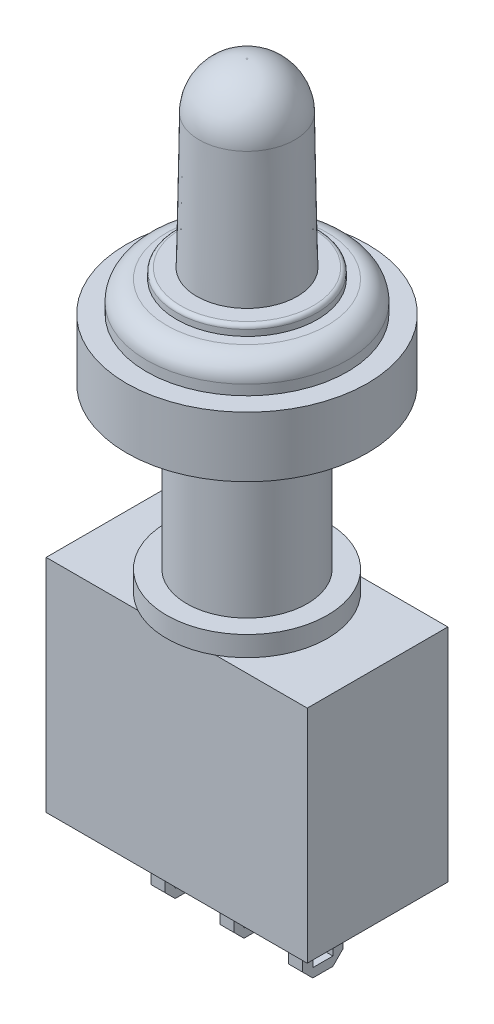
ISO-10303-21;
HEADER;
FILE_DESCRIPTION(('STEP AP214'),'2;1');
FILE_NAME('part.step','',(''),(''),'','','');
FILE_SCHEMA(('AUTOMOTIVE_DESIGN { 1 0 10303 214 1 1 1 1 }'));
ENDSEC;
DATA;
#1=APPLICATION_CONTEXT('core data for automotive mechanical design processes');
#2=APPLICATION_PROTOCOL_DEFINITION('international standard','automotive_design',2000,#1);
#3=PRODUCT_CONTEXT('',#1,'mechanical');
#4=PRODUCT('Part','Part','',(#3));
#5=PRODUCT_RELATED_PRODUCT_CATEGORY('part','',(#4));
#6=PRODUCT_DEFINITION_FORMATION('','',#4);
#7=PRODUCT_DEFINITION_CONTEXT('part definition',#1,'design');
#8=PRODUCT_DEFINITION('design','',#6,#7);
#9=PRODUCT_DEFINITION_SHAPE('','',#8);
#10=(LENGTH_UNIT() NAMED_UNIT(*) SI_UNIT(.MILLI.,.METRE.));
#11=(NAMED_UNIT(*) PLANE_ANGLE_UNIT() SI_UNIT($,.RADIAN.));
#12=(NAMED_UNIT(*) SI_UNIT($,.STERADIAN.) SOLID_ANGLE_UNIT());
#13=UNCERTAINTY_MEASURE_WITH_UNIT(LENGTH_MEASURE(1.E-05),#10,'distance_accuracy_value','');
#14=(GEOMETRIC_REPRESENTATION_CONTEXT(3) GLOBAL_UNCERTAINTY_ASSIGNED_CONTEXT((#13)) GLOBAL_UNIT_ASSIGNED_CONTEXT((#10,
#11,#12)) REPRESENTATION_CONTEXT('',''));
#15=CARTESIAN_POINT('',(0.,0.,0.));
#16=DIRECTION('',(0.,0.,1.));
#17=DIRECTION('',(1.,0.,0.));
#18=AXIS2_PLACEMENT_3D('',#15,#16,#17);
#19=CARTESIAN_POINT('',(-40.,9.00000000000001,6.99999999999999));
#20=DIRECTION('',(0.,1.,0.));
#21=DIRECTION('',(-1.,0.,0.));
#22=AXIS2_PLACEMENT_3D('',#19,#20,#21);
#23=PLANE('',#22);
#24=DIRECTION('',(0.,0.,-1.));
#25=VECTOR('',#24,1.);
#26=CARTESIAN_POINT('',(-33.85,9.00000000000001,4.49999999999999));
#27=LINE('',#26,#25);
#28=CARTESIAN_POINT('',(-33.85,9.00000000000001,4.49999999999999));
#29=VERTEX_POINT('',#28);
#30=CARTESIAN_POINT('',(-33.85,9.00000000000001,2.5));
#31=VERTEX_POINT('',#30);
#32=EDGE_CURVE('E398',#29,#31,#27,.T.);
#33=ORIENTED_EDGE('',*,*,#32,.F.);
#34=DIRECTION('',(-1.,0.,0.));
#35=VECTOR('',#34,1.);
#36=CARTESIAN_POINT('',(-33.85,9.00000000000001,4.49999999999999));
#37=LINE('',#36,#35);
#38=CARTESIAN_POINT('',(-33.15,8.99999999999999,4.49999999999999));
#39=VERTEX_POINT('',#38);
#40=EDGE_CURVE('E407',#39,#29,#37,.T.);
#41=ORIENTED_EDGE('',*,*,#40,.F.);
#42=DIRECTION('',(0.,0.,1.));
#43=VECTOR('',#42,1.);
#44=CARTESIAN_POINT('',(-33.15,8.99999999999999,4.49999999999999));
#45=LINE('',#44,#43);
#46=CARTESIAN_POINT('',(-33.15,9.00000000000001,2.5));
#47=VERTEX_POINT('',#46);
#48=EDGE_CURVE('E404',#47,#39,#45,.T.);
#49=ORIENTED_EDGE('',*,*,#48,.F.);
#50=DIRECTION('',(1.,0.,0.));
#51=VECTOR('',#50,1.);
#52=CARTESIAN_POINT('',(-33.85,9.00000000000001,2.5));
#53=LINE('',#52,#51);
#54=EDGE_CURVE('E401',#31,#47,#53,.T.);
#55=ORIENTED_EDGE('',*,*,#54,.F.);
#56=EDGE_LOOP('',(#33,#41,#49,#55));
#57=FACE_BOUND('',#56,.T.);
#58=DIRECTION('',(1.,0.,0.));
#59=VECTOR('',#58,1.);
#60=CARTESIAN_POINT('',(-40.,9.00000000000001,0.));
#61=LINE('',#60,#59);
#62=CARTESIAN_POINT('',(-40.,9.00000000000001,0.));
#63=VERTEX_POINT('',#62);
#64=CARTESIAN_POINT('',(-27.,9.00000000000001,0.));
#65=VERTEX_POINT('',#64);
#66=EDGE_CURVE('E483',#63,#65,#61,.T.);
#67=ORIENTED_EDGE('',*,*,#66,.T.);
#68=DIRECTION('',(0.,0.,-1.));
#69=VECTOR('',#68,1.);
#70=CARTESIAN_POINT('',(-27.,9.00000000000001,7.));
#71=LINE('',#70,#69);
#72=CARTESIAN_POINT('',(-27.,9.00000000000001,7.));
#73=VERTEX_POINT('',#72);
#74=EDGE_CURVE('E510',#73,#65,#71,.T.);
#75=ORIENTED_EDGE('',*,*,#74,.F.);
#76=DIRECTION('',(1.,0.,0.));
#77=VECTOR('',#76,1.);
#78=CARTESIAN_POINT('',(-40.,9.00000000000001,6.99999999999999));
#79=LINE('',#78,#77);
#80=CARTESIAN_POINT('',(-40.,9.00000000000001,6.99999999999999));
#81=VERTEX_POINT('',#80);
#82=EDGE_CURVE('E495',#81,#73,#79,.T.);
#83=ORIENTED_EDGE('',*,*,#82,.F.);
#84=DIRECTION('',(0.,0.,-1.));
#85=VECTOR('',#84,1.);
#86=CARTESIAN_POINT('',(-40.,9.00000000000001,6.99999999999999));
#87=LINE('',#86,#85);
#88=EDGE_CURVE('E513',#81,#63,#87,.T.);
#89=ORIENTED_EDGE('',*,*,#88,.T.);
#90=EDGE_LOOP('',(#67,#75,#83,#89));
#91=FACE_BOUND('',#90,.T.);
#92=DIRECTION('',(0.,0.,-1.));
#93=VECTOR('',#92,1.);
#94=CARTESIAN_POINT('',(-37.275,9.00000000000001,4.5));
#95=LINE('',#94,#93);
#96=CARTESIAN_POINT('',(-37.275,9.00000000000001,4.5));
#97=VERTEX_POINT('',#96);
#98=CARTESIAN_POINT('',(-37.275,9.00000000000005,2.49999999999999));
#99=VERTEX_POINT('',#98);
#100=EDGE_CURVE('E424',#97,#99,#95,.T.);
#101=ORIENTED_EDGE('',*,*,#100,.F.);
#102=DIRECTION('',(-1.,0.,0.));
#103=VECTOR('',#102,1.);
#104=CARTESIAN_POINT('',(-37.275,9.00000000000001,4.5));
#105=LINE('',#104,#103);
#106=CARTESIAN_POINT('',(-36.575,9.00000000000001,4.5));
#107=VERTEX_POINT('',#106);
#108=EDGE_CURVE('E433',#107,#97,#105,.T.);
#109=ORIENTED_EDGE('',*,*,#108,.F.);
#110=DIRECTION('',(0.,0.,1.));
#111=VECTOR('',#110,1.);
#112=CARTESIAN_POINT('',(-36.575,9.00000000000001,4.5));
#113=LINE('',#112,#111);
#114=CARTESIAN_POINT('',(-36.575,9.00000000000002,2.49999999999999));
#115=VERTEX_POINT('',#114);
#116=EDGE_CURVE('E430',#115,#107,#113,.T.);
#117=ORIENTED_EDGE('',*,*,#116,.F.);
#118=DIRECTION('',(1.,0.,0.));
#119=VECTOR('',#118,1.);
#120=CARTESIAN_POINT('',(-37.275,9.00000000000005,2.5));
#121=LINE('',#120,#119);
#122=EDGE_CURVE('E427',#99,#115,#121,.T.);
#123=ORIENTED_EDGE('',*,*,#122,.F.);
#124=EDGE_LOOP('',(#101,#109,#117,#123));
#125=FACE_BOUND('',#124,.T.);
#126=DIRECTION('',(0.,0.,-1.));
#127=VECTOR('',#126,1.);
#128=CARTESIAN_POINT('',(-30.425,9.00000000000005,4.5));
#129=LINE('',#128,#127);
#130=CARTESIAN_POINT('',(-30.425,9.00000000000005,4.5));
#131=VERTEX_POINT('',#130);
#132=CARTESIAN_POINT('',(-30.425,9.00000000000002,2.49999999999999));
#133=VERTEX_POINT('',#132);
#134=EDGE_CURVE('E372',#131,#133,#129,.T.);
#135=ORIENTED_EDGE('',*,*,#134,.F.);
#136=DIRECTION('',(-1.,0.,0.));
#137=VECTOR('',#136,1.);
#138=CARTESIAN_POINT('',(-30.425,9.00000000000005,4.5));
#139=LINE('',#138,#137);
#140=CARTESIAN_POINT('',(-29.725,9.00000000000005,4.5));
#141=VERTEX_POINT('',#140);
#142=EDGE_CURVE('E381',#141,#131,#139,.T.);
#143=ORIENTED_EDGE('',*,*,#142,.F.);
#144=DIRECTION('',(0.,0.,1.));
#145=VECTOR('',#144,1.);
#146=CARTESIAN_POINT('',(-29.725,9.00000000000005,4.5));
#147=LINE('',#146,#145);
#148=CARTESIAN_POINT('',(-29.725,9.00000000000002,2.5));
#149=VERTEX_POINT('',#148);
#150=EDGE_CURVE('E378',#149,#141,#147,.T.);
#151=ORIENTED_EDGE('',*,*,#150,.F.);
#152=DIRECTION('',(1.,0.,0.));
#153=VECTOR('',#152,1.);
#154=CARTESIAN_POINT('',(-30.425,9.00000000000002,2.49999999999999));
#155=LINE('',#154,#153);
#156=EDGE_CURVE('E375',#133,#149,#155,.T.);
#157=ORIENTED_EDGE('',*,*,#156,.F.);
#158=EDGE_LOOP('',(#135,#143,#151,#157));
#159=FACE_BOUND('',#158,.T.);
#160=ADVANCED_FACE('F39',(#57,#91,#125,#159),#23,.F.);
#161=CARTESIAN_POINT('',(-33.5,34.,3.5));
#162=DIRECTION('',(0.,1.,0.));
#163=DIRECTION('',(0.,0.,1.));
#164=AXIS2_PLACEMENT_3D('',#161,#162,#163);
#165=PLANE('',#164);
#166=CARTESIAN_POINT('',(-33.5,34.,3.5));
#167=DIRECTION('',(0.,1.,0.));
#168=DIRECTION('',(0.,0.,1.));
#169=AXIS2_PLACEMENT_3D('',#166,#167,#168);
#170=CIRCLE('',#169,3.3);
#171=CARTESIAN_POINT('',(-33.5,34.,6.8));
#172=VERTEX_POINT('',#171);
#173=EDGE_CURVE('E522',#172,#172,#170,.T.);
#174=ORIENTED_EDGE('',*,*,#173,.T.);
#175=EDGE_LOOP('',(#174));
#176=FACE_BOUND('',#175,.T.);
#177=CARTESIAN_POINT('',(-33.5,34.,3.5));
#178=DIRECTION('',(0.,1.,0.));
#179=DIRECTION('',(0.,0.,1.));
#180=AXIS2_PLACEMENT_3D('',#177,#178,#179);
#181=CIRCLE('',#180,2.5);
#182=CARTESIAN_POINT('',(-33.5,34.,6.));
#183=VERTEX_POINT('',#182);
#184=EDGE_CURVE('E450',#183,#183,#181,.T.);
#185=ORIENTED_EDGE('',*,*,#184,.F.);
#186=EDGE_LOOP('',(#185));
#187=FACE_BOUND('',#186,.T.);
#188=ADVANCED_FACE('F614',(#176,#187),#165,.T.);
#189=CARTESIAN_POINT('',(-33.5,33.5,3.5));
#190=DIRECTION('',(0.,1.,0.));
#191=DIRECTION('',(0.,0.,1.));
#192=AXIS2_PLACEMENT_3D('',#189,#190,#191);
#193=PLANE('',#192);
#194=CARTESIAN_POINT('',(-33.5,33.5,3.5));
#195=DIRECTION('',(0.,1.,0.));
#196=DIRECTION('',(0.,0.,1.));
#197=AXIS2_PLACEMENT_3D('',#194,#195,#196);
#198=CIRCLE('',#197,4.);
#199=CARTESIAN_POINT('',(-33.5,33.5,7.5));
#200=VERTEX_POINT('',#199);
#201=EDGE_CURVE('E516',#200,#200,#198,.T.);
#202=ORIENTED_EDGE('',*,*,#201,.T.);
#203=EDGE_LOOP('',(#202));
#204=FACE_BOUND('',#203,.T.);
#205=CARTESIAN_POINT('',(-33.5,33.5,3.5));
#206=DIRECTION('',(0.,1.,0.));
#207=DIRECTION('',(0.,0.,1.));
#208=AXIS2_PLACEMENT_3D('',#205,#206,#207);
#209=CIRCLE('',#208,3.5);
#210=CARTESIAN_POINT('',(-33.5,33.5,7.));
#211=VERTEX_POINT('',#210);
#212=EDGE_CURVE('E453',#211,#211,#209,.T.);
#213=ORIENTED_EDGE('',*,*,#212,.F.);
#214=EDGE_LOOP('',(#213));
#215=FACE_BOUND('',#214,.T.);
#216=ADVANCED_FACE('F621',(#204,#215),#193,.T.);
#217=CARTESIAN_POINT('',(-33.5,32.,3.5));
#218=DIRECTION('',(0.,1.,0.));
#219=DIRECTION('',(0.,0.,1.));
#220=AXIS2_PLACEMENT_3D('',#217,#218,#219);
#221=PLANE('',#220);
#222=CARTESIAN_POINT('',(-33.5,32.,3.5));
#223=DIRECTION('',(0.,1.,0.));
#224=DIRECTION('',(0.,0.,1.));
#225=AXIS2_PLACEMENT_3D('',#222,#223,#224);
#226=CIRCLE('',#225,5.99999999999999);
#227=CARTESIAN_POINT('',(-33.5,32.,9.49999999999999));
#228=VERTEX_POINT('',#227);
#229=EDGE_CURVE('E462',#228,#228,#226,.T.);
#230=ORIENTED_EDGE('',*,*,#229,.T.);
#231=EDGE_LOOP('',(#230));
#232=FACE_BOUND('',#231,.T.);
#233=CARTESIAN_POINT('',(-33.5,32.,3.5));
#234=DIRECTION('',(0.,1.,0.));
#235=DIRECTION('',(0.,0.,1.));
#236=AXIS2_PLACEMENT_3D('',#233,#234,#235);
#237=CIRCLE('',#236,5.);
#238=CARTESIAN_POINT('',(-33.5,32.,8.49999999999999));
#239=VERTEX_POINT('',#238);
#240=EDGE_CURVE('E456',#239,#239,#237,.T.);
#241=ORIENTED_EDGE('',*,*,#240,.F.);
#242=EDGE_LOOP('',(#241));
#243=FACE_BOUND('',#242,.T.);
#244=ADVANCED_FACE('F653',(#232,#243),#221,.T.);
#245=CARTESIAN_POINT('',(-33.5,21.,3.5));
#246=DIRECTION('',(0.,1.,0.));
#247=DIRECTION('',(0.,0.,1.));
#248=AXIS2_PLACEMENT_3D('',#245,#246,#247);
#249=PLANE('',#248);
#250=CARTESIAN_POINT('',(-33.5,21.,3.5));
#251=DIRECTION('',(0.,1.,0.));
#252=DIRECTION('',(0.,0.,1.));
#253=AXIS2_PLACEMENT_3D('',#250,#251,#252);
#254=CIRCLE('',#253,4.00000000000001);
#255=CARTESIAN_POINT('',(-33.5,21.,7.50000000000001));
#256=VERTEX_POINT('',#255);
#257=EDGE_CURVE('E475',#256,#256,#254,.T.);
#258=ORIENTED_EDGE('',*,*,#257,.T.);
#259=EDGE_LOOP('',(#258));
#260=FACE_BOUND('',#259,.T.);
#261=CARTESIAN_POINT('',(-33.5,21.,3.5));
#262=DIRECTION('',(0.,1.,0.));
#263=DIRECTION('',(0.,0.,1.));
#264=AXIS2_PLACEMENT_3D('',#261,#262,#263);
#265=CIRCLE('',#264,3.);
#266=CARTESIAN_POINT('',(-33.5,21.,6.5));
#267=VERTEX_POINT('',#266);
#268=EDGE_CURVE('E465',#267,#267,#265,.T.);
#269=ORIENTED_EDGE('',*,*,#268,.F.);
#270=EDGE_LOOP('',(#269));
#271=FACE_BOUND('',#270,.T.);
#272=ADVANCED_FACE('F636',(#260,#271),#249,.T.);
#273=CARTESIAN_POINT('',(-40.,20.,6.99999999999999));
#274=DIRECTION('',(0.,-1.,0.));
#275=DIRECTION('',(0.,0.,-1.));
#276=AXIS2_PLACEMENT_3D('',#273,#274,#275);
#277=PLANE('',#276);
#278=CARTESIAN_POINT('',(-33.5,20.,3.5));
#279=DIRECTION('',(0.,1.,0.));
#280=DIRECTION('',(0.,0.,1.));
#281=AXIS2_PLACEMENT_3D('',#278,#279,#280);
#282=CIRCLE('',#281,4.00000000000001);
#283=CARTESIAN_POINT('',(-31.5635083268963,20.,6.99999999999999));
#284=VERTEX_POINT('',#283);
#285=CARTESIAN_POINT('',(-31.5635083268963,20.,0.));
#286=VERTEX_POINT('',#285);
#287=EDGE_CURVE('E472',#284,#286,#282,.T.);
#288=ORIENTED_EDGE('',*,*,#287,.F.);
#289=DIRECTION('',(-1.,0.,0.));
#290=VECTOR('',#289,1.);
#291=CARTESIAN_POINT('',(-40.,20.,6.99999999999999));
#292=LINE('',#291,#290);
#293=CARTESIAN_POINT('',(-27.,20.,7.));
#294=VERTEX_POINT('',#293);
#295=EDGE_CURVE('E500',#294,#284,#292,.T.);
#296=ORIENTED_EDGE('',*,*,#295,.F.);
#297=DIRECTION('',(0.,0.,-1.));
#298=VECTOR('',#297,1.);
#299=CARTESIAN_POINT('',(-27.,20.,7.));
#300=LINE('',#299,#298);
#301=CARTESIAN_POINT('',(-27.,20.,0.));
#302=VERTEX_POINT('',#301);
#303=EDGE_CURVE('E507',#294,#302,#300,.T.);
#304=ORIENTED_EDGE('',*,*,#303,.T.);
#305=DIRECTION('',(-1.,0.,0.));
#306=VECTOR('',#305,1.);
#307=CARTESIAN_POINT('',(-40.,20.,0.));
#308=LINE('',#307,#306);
#309=EDGE_CURVE('E488',#302,#286,#308,.T.);
#310=ORIENTED_EDGE('',*,*,#309,.T.);
#311=EDGE_LOOP('',(#288,#296,#304,#310));
#312=FACE_BOUND('',#311,.T.);
#313=ADVANCED_FACE('F632',(#312),#277,.F.);
#314=CARTESIAN_POINT('',(-35.4364916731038,20.,0.));
#315=VERTEX_POINT('',#314);
#316=CARTESIAN_POINT('',(-35.4364916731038,20.,6.99999999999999));
#317=VERTEX_POINT('',#316);
#318=EDGE_CURVE('E477',#315,#317,#282,.T.);
#319=ORIENTED_EDGE('',*,*,#318,.F.);
#320=CARTESIAN_POINT('',(-40.,20.,0.));
#321=VERTEX_POINT('',#320);
#322=EDGE_CURVE('E487',#315,#321,#308,.T.);
#323=ORIENTED_EDGE('',*,*,#322,.T.);
#324=DIRECTION('',(0.,0.,-1.));
#325=VECTOR('',#324,1.);
#326=CARTESIAN_POINT('',(-40.,20.,6.99999999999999));
#327=LINE('',#326,#325);
#328=CARTESIAN_POINT('',(-40.,20.,6.99999999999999));
#329=VERTEX_POINT('',#328);
#330=EDGE_CURVE('E503',#329,#321,#327,.T.);
#331=ORIENTED_EDGE('',*,*,#330,.F.);
#332=EDGE_CURVE('E499',#317,#329,#292,.T.);
#333=ORIENTED_EDGE('',*,*,#332,.F.);
#334=EDGE_LOOP('',(#319,#323,#331,#333));
#335=FACE_BOUND('',#334,.T.);
#336=ADVANCED_FACE('F635',(#335),#277,.F.);
#337=CARTESIAN_POINT('',(-40.,20.,6.99999999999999));
#338=DIRECTION('',(1.,0.,0.));
#339=DIRECTION('',(0.,1.,0.));
#340=AXIS2_PLACEMENT_3D('',#337,#338,#339);
#341=PLANE('',#340);
#342=DIRECTION('',(0.,-1.,0.));
#343=VECTOR('',#342,1.);
#344=CARTESIAN_POINT('',(-40.,20.,0.));
#345=LINE('',#344,#343);
#346=EDGE_CURVE('E480',#321,#63,#345,.T.);
#347=ORIENTED_EDGE('',*,*,#346,.T.);
#348=ORIENTED_EDGE('',*,*,#88,.F.);
#349=DIRECTION('',(0.,-1.,0.));
#350=VECTOR('',#349,1.);
#351=CARTESIAN_POINT('',(-40.,20.,6.99999999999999));
#352=LINE('',#351,#350);
#353=EDGE_CURVE('E491',#329,#81,#352,.T.);
#354=ORIENTED_EDGE('',*,*,#353,.F.);
#355=ORIENTED_EDGE('',*,*,#330,.T.);
#356=EDGE_LOOP('',(#347,#348,#354,#355));
#357=FACE_BOUND('',#356,.T.);
#358=ADVANCED_FACE('F41',(#357),#341,.F.);
#359=CARTESIAN_POINT('',(-27.,20.,7.));
#360=DIRECTION('',(-1.,0.,0.));
#361=DIRECTION('',(0.,0.,1.));
#362=AXIS2_PLACEMENT_3D('',#359,#360,#361);
#363=PLANE('',#362);
#364=DIRECTION('',(0.,1.,0.));
#365=VECTOR('',#364,1.);
#366=CARTESIAN_POINT('',(-27.,20.,0.));
#367=LINE('',#366,#365);
#368=EDGE_CURVE('E485',#65,#302,#367,.T.);
#369=ORIENTED_EDGE('',*,*,#368,.T.);
#370=ORIENTED_EDGE('',*,*,#303,.F.);
#371=DIRECTION('',(0.,1.,0.));
#372=VECTOR('',#371,1.);
#373=CARTESIAN_POINT('',(-27.,20.,7.));
#374=LINE('',#373,#372);
#375=EDGE_CURVE('E497',#73,#294,#374,.T.);
#376=ORIENTED_EDGE('',*,*,#375,.F.);
#377=ORIENTED_EDGE('',*,*,#74,.T.);
#378=EDGE_LOOP('',(#369,#370,#376,#377));
#379=FACE_BOUND('',#378,.T.);
#380=ADVANCED_FACE('F627',(#379),#363,.F.);
#381=CARTESIAN_POINT('',(-40.,9.00000000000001,6.99999999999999));
#382=DIRECTION('',(0.,0.,1.));
#383=DIRECTION('',(1.,0.,0.));
#384=AXIS2_PLACEMENT_3D('',#381,#382,#383);
#385=PLANE('',#384);
#386=ORIENTED_EDGE('',*,*,#353,.T.);
#387=ORIENTED_EDGE('',*,*,#82,.T.);
#388=ORIENTED_EDGE('',*,*,#375,.T.);
#389=ORIENTED_EDGE('',*,*,#295,.T.);
#390=EDGE_CURVE('E504',#284,#317,#292,.T.);
#391=ORIENTED_EDGE('',*,*,#390,.T.);
#392=ORIENTED_EDGE('',*,*,#332,.T.);
#393=EDGE_LOOP('',(#386,#387,#388,#389,#391,#392));
#394=FACE_BOUND('',#393,.T.);
#395=ADVANCED_FACE('F630',(#394),#385,.T.);
#396=CARTESIAN_POINT('',(-40.,9.00000000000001,0.));
#397=DIRECTION('',(0.,0.,1.));
#398=DIRECTION('',(1.,0.,0.));
#399=AXIS2_PLACEMENT_3D('',#396,#397,#398);
#400=PLANE('',#399);
#401=ORIENTED_EDGE('',*,*,#346,.F.);
#402=ORIENTED_EDGE('',*,*,#322,.F.);
#403=EDGE_CURVE('E492',#286,#315,#308,.T.);
#404=ORIENTED_EDGE('',*,*,#403,.F.);
#405=ORIENTED_EDGE('',*,*,#309,.F.);
#406=ORIENTED_EDGE('',*,*,#368,.F.);
#407=ORIENTED_EDGE('',*,*,#66,.F.);
#408=EDGE_LOOP('',(#401,#402,#404,#405,#406,#407));
#409=FACE_BOUND('',#408,.T.);
#410=ADVANCED_FACE('F640',(#409),#400,.F.);
#411=CARTESIAN_POINT('',(-33.5,20.,3.5));
#412=DIRECTION('',(0.,1.,0.));
#413=DIRECTION('',(0.,0.,1.));
#414=AXIS2_PLACEMENT_3D('',#411,#412,#413);
#415=PLANE('',#414);
#416=EDGE_CURVE('E476',#286,#315,#282,.T.);
#417=ORIENTED_EDGE('',*,*,#416,.F.);
#418=ORIENTED_EDGE('',*,*,#403,.T.);
#419=EDGE_LOOP('',(#417,#418));
#420=FACE_BOUND('',#419,.T.);
#421=ADVANCED_FACE('F644',(#420),#415,.F.);
#422=CARTESIAN_POINT('',(-33.5,21.,3.5));
#423=DIRECTION('',(0.,-1.,0.));
#424=DIRECTION('',(0.,0.,-1.));
#425=AXIS2_PLACEMENT_3D('',#422,#423,#424);
#426=CYLINDRICAL_SURFACE('',#425,4.00000000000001);
#427=ORIENTED_EDGE('',*,*,#257,.F.);
#428=EDGE_LOOP('',(#427));
#429=FACE_BOUND('',#428,.T.);
#430=ORIENTED_EDGE('',*,*,#287,.T.);
#431=ORIENTED_EDGE('',*,*,#416,.T.);
#432=ORIENTED_EDGE('',*,*,#318,.T.);
#433=EDGE_CURVE('E471',#317,#284,#282,.T.);
#434=ORIENTED_EDGE('',*,*,#433,.T.);
#435=EDGE_LOOP('',(#430,#431,#432,#434));
#436=FACE_BOUND('',#435,.T.);
#437=ADVANCED_FACE('F646',(#429,#436),#426,.T.);
#438=ORIENTED_EDGE('',*,*,#390,.F.);
#439=ORIENTED_EDGE('',*,*,#433,.F.);
#440=EDGE_LOOP('',(#438,#439));
#441=FACE_BOUND('',#440,.T.);
#442=ADVANCED_FACE('F649',(#441),#415,.F.);
#443=CARTESIAN_POINT('',(-33.5,29.,3.5));
#444=DIRECTION('',(0.,-1.,0.));
#445=DIRECTION('',(0.,0.,-1.));
#446=AXIS2_PLACEMENT_3D('',#443,#444,#445);
#447=CYLINDRICAL_SURFACE('',#446,3.);
#448=CARTESIAN_POINT('',(-33.5,29.,3.5));
#449=DIRECTION('',(0.,1.,0.));
#450=DIRECTION('',(0.,0.,1.));
#451=AXIS2_PLACEMENT_3D('',#448,#449,#450);
#452=CIRCLE('',#451,3.);
#453=CARTESIAN_POINT('',(-33.5,29.,6.5));
#454=VERTEX_POINT('',#453);
#455=EDGE_CURVE('E468',#454,#454,#452,.T.);
#456=ORIENTED_EDGE('',*,*,#455,.F.);
#457=EDGE_LOOP('',(#456));
#458=FACE_BOUND('',#457,.T.);
#459=ORIENTED_EDGE('',*,*,#268,.T.);
#460=EDGE_LOOP('',(#459));
#461=FACE_BOUND('',#460,.T.);
#462=ADVANCED_FACE('F657',(#458,#461),#447,.T.);
#463=CARTESIAN_POINT('',(-33.5,29.,3.5));
#464=DIRECTION('',(0.,1.,0.));
#465=DIRECTION('',(0.,0.,1.));
#466=AXIS2_PLACEMENT_3D('',#463,#464,#465);
#467=PLANE('',#466);
#468=CARTESIAN_POINT('',(-33.5,29.,3.5));
#469=DIRECTION('',(0.,1.,0.));
#470=DIRECTION('',(0.,0.,1.));
#471=AXIS2_PLACEMENT_3D('',#468,#469,#470);
#472=CIRCLE('',#471,5.99999999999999);
#473=CARTESIAN_POINT('',(-33.5,29.,9.49999999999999));
#474=VERTEX_POINT('',#473);
#475=EDGE_CURVE('E459',#474,#474,#472,.T.);
#476=ORIENTED_EDGE('',*,*,#475,.F.);
#477=EDGE_LOOP('',(#476));
#478=FACE_BOUND('',#477,.T.);
#479=ORIENTED_EDGE('',*,*,#455,.T.);
#480=EDGE_LOOP('',(#479));
#481=FACE_BOUND('',#480,.T.);
#482=ADVANCED_FACE('F661',(#478,#481),#467,.F.);
#483=CARTESIAN_POINT('',(-33.5,32.,3.5));
#484=DIRECTION('',(0.,-1.,0.));
#485=DIRECTION('',(0.,0.,-1.));
#486=AXIS2_PLACEMENT_3D('',#483,#484,#485);
#487=CYLINDRICAL_SURFACE('',#486,5.99999999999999);
#488=ORIENTED_EDGE('',*,*,#229,.F.);
#489=EDGE_LOOP('',(#488));
#490=FACE_BOUND('',#489,.T.);
#491=ORIENTED_EDGE('',*,*,#475,.T.);
#492=EDGE_LOOP('',(#491));
#493=FACE_BOUND('',#492,.T.);
#494=ADVANCED_FACE('F663',(#490,#493),#487,.T.);
#495=CARTESIAN_POINT('',(-33.5,33.5,3.5));
#496=DIRECTION('',(0.,-1.,0.));
#497=DIRECTION('',(0.,0.,-1.));
#498=AXIS2_PLACEMENT_3D('',#495,#496,#497);
#499=CYLINDRICAL_SURFACE('',#498,5.);
#500=CARTESIAN_POINT('',(-33.5,32.5,3.5));
#501=DIRECTION('',(0.,1.,0.));
#502=DIRECTION('',(0.,0.,1.));
#503=AXIS2_PLACEMENT_3D('',#500,#501,#502);
#504=CIRCLE('',#503,5.);
#505=CARTESIAN_POINT('',(-33.5,32.5,8.49999999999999));
#506=VERTEX_POINT('',#505);
#507=EDGE_CURVE('E519',#506,#506,#504,.F.);
#508=ORIENTED_EDGE('',*,*,#507,.T.);
#509=EDGE_LOOP('',(#508));
#510=FACE_BOUND('',#509,.T.);
#511=ORIENTED_EDGE('',*,*,#240,.T.);
#512=EDGE_LOOP('',(#511));
#513=FACE_BOUND('',#512,.T.);
#514=ADVANCED_FACE('F666',(#510,#513),#499,.T.);
#515=CARTESIAN_POINT('',(-33.5,32.5,3.5));
#516=DIRECTION('',(0.,1.,0.));
#517=DIRECTION('',(0.,0.,1.));
#518=AXIS2_PLACEMENT_3D('',#515,#516,#517);
#519=TOROIDAL_SURFACE('',#518,4.,1.);
#520=ORIENTED_EDGE('',*,*,#507,.F.);
#521=EDGE_LOOP('',(#520));
#522=FACE_BOUND('',#521,.T.);
#523=ORIENTED_EDGE('',*,*,#201,.F.);
#524=EDGE_LOOP('',(#523));
#525=FACE_BOUND('',#524,.T.);
#526=ADVANCED_FACE('F676',(#522,#525),#519,.T.);
#527=CARTESIAN_POINT('',(-33.5,34.,3.5));
#528=DIRECTION('',(0.,-1.,0.));
#529=DIRECTION('',(0.,0.,-1.));
#530=AXIS2_PLACEMENT_3D('',#527,#528,#529);
#531=CYLINDRICAL_SURFACE('',#530,3.5);
#532=CARTESIAN_POINT('',(-33.5,33.8,3.5));
#533=DIRECTION('',(0.,1.,0.));
#534=DIRECTION('',(0.,0.,1.));
#535=AXIS2_PLACEMENT_3D('',#532,#533,#534);
#536=CIRCLE('',#535,3.5);
#537=CARTESIAN_POINT('',(-33.5,33.8,7.));
#538=VERTEX_POINT('',#537);
#539=EDGE_CURVE('E525',#538,#538,#536,.F.);
#540=ORIENTED_EDGE('',*,*,#539,.T.);
#541=EDGE_LOOP('',(#540));
#542=FACE_BOUND('',#541,.T.);
#543=ORIENTED_EDGE('',*,*,#212,.T.);
#544=EDGE_LOOP('',(#543));
#545=FACE_BOUND('',#544,.T.);
#546=ADVANCED_FACE('F683',(#542,#545),#531,.T.);
#547=CARTESIAN_POINT('',(-33.5,33.8,3.5));
#548=DIRECTION('',(0.,1.,0.));
#549=DIRECTION('',(0.,0.,1.));
#550=AXIS2_PLACEMENT_3D('',#547,#548,#549);
#551=TOROIDAL_SURFACE('',#550,3.3,0.2);
#552=ORIENTED_EDGE('',*,*,#539,.F.);
#553=EDGE_LOOP('',(#552));
#554=FACE_BOUND('',#553,.T.);
#555=ORIENTED_EDGE('',*,*,#173,.F.);
#556=EDGE_LOOP('',(#555));
#557=FACE_BOUND('',#556,.T.);
#558=ADVANCED_FACE('F686',(#554,#557),#551,.T.);
#559=CARTESIAN_POINT('',(-33.5,34.,3.5));
#560=DIRECTION('',(0.,-1.,0.));
#561=DIRECTION('',(0.,0.,1.));
#562=AXIS2_PLACEMENT_3D('',#559,#560,#561);
#563=CONICAL_SURFACE('',#562,2.5,0.0174532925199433);
#564=CARTESIAN_POINT('',(-33.5,40.6910131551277,3.49999999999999));
#565=DIRECTION('',(0.,-1.,0.));
#566=DIRECTION('',(0.,0.,-1.));
#567=AXIS2_PLACEMENT_3D('',#564,#565,#566);
#568=CIRCLE('',#567,2.38320793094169);
#569=CARTESIAN_POINT('',(-33.5,40.6910131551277,1.1167920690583));
#570=VERTEX_POINT('',#569);
#571=EDGE_CURVE('E531',#570,#570,#568,.T.);
#572=ORIENTED_EDGE('',*,*,#571,.T.);
#573=EDGE_LOOP('',(#572));
#574=FACE_BOUND('',#573,.T.);
#575=ORIENTED_EDGE('',*,*,#184,.T.);
#576=EDGE_LOOP('',(#575));
#577=FACE_BOUND('',#576,.T.);
#578=ADVANCED_FACE('F691',(#574,#577),#563,.T.);
#579=CARTESIAN_POINT('',(-33.5,43.,3.49999999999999));
#580=DIRECTION('',(0.,1.,0.));
#581=DIRECTION('',(0.,0.,1.));
#582=AXIS2_PLACEMENT_3D('',#579,#580,#581);
#583=PLANE('',#582);
#584=CARTESIAN_POINT('',(-33.5,43.,3.49999999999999));
#585=DIRECTION('',(0.,1.,0.));
#586=DIRECTION('',(0.,0.,1.));
#587=AXIS2_PLACEMENT_3D('',#584,#585,#586);
#588=CIRCLE('',#587,0.0335658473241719);
#589=CARTESIAN_POINT('',(-33.5,43.,3.53356584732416));
#590=VERTEX_POINT('',#589);
#591=EDGE_CURVE('E528',#590,#590,#588,.T.);
#592=ORIENTED_EDGE('',*,*,#591,.T.);
#593=EDGE_LOOP('',(#592));
#594=FACE_BOUND('',#593,.T.);
#595=ADVANCED_FACE('F695',(#594),#583,.T.);
#596=CARTESIAN_POINT('',(-33.5,40.65,3.49999999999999));
#597=DIRECTION('',(0.,1.,0.));
#598=DIRECTION('',(0.,0.,1.));
#599=AXIS2_PLACEMENT_3D('',#596,#597,#598);
#600=DEGENERATE_TOROIDAL_SURFACE('',#599,0.0335658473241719,2.35,.T.);
#601=ORIENTED_EDGE('',*,*,#571,.F.);
#602=EDGE_LOOP('',(#601));
#603=FACE_BOUND('',#602,.T.);
#604=ORIENTED_EDGE('',*,*,#591,.F.);
#605=EDGE_LOOP('',(#604));
#606=FACE_BOUND('',#605,.T.);
#607=ADVANCED_FACE('F699',(#603,#606),#600,.T.);
#608=CARTESIAN_POINT('',(-37.275,5.50000000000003,4.5));
#609=DIRECTION('',(1.,0.,0.));
#610=DIRECTION('',(0.,1.,0.));
#611=AXIS2_PLACEMENT_3D('',#608,#609,#610);
#612=PLANE('',#611);
#613=DIRECTION('',(0.,0.,-1.));
#614=VECTOR('',#613,1.);
#615=CARTESIAN_POINT('',(-37.275,5.94672955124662,4.5));
#616=LINE('',#615,#614);
#617=CARTESIAN_POINT('',(-37.275,5.94672955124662,4.));
#618=VERTEX_POINT('',#617);
#619=CARTESIAN_POINT('',(-37.275,5.94672955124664,2.99999999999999));
#620=VERTEX_POINT('',#619);
#621=EDGE_CURVE('E354',#618,#620,#616,.T.);
#622=ORIENTED_EDGE('',*,*,#621,.T.);
#623=DIRECTION('',(0.,1.,0.));
#624=VECTOR('',#623,1.);
#625=CARTESIAN_POINT('',(-37.275,5.49999999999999,2.99999999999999));
#626=LINE('',#625,#624);
#627=CARTESIAN_POINT('',(-37.275,8.4251389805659,3.));
#628=VERTEX_POINT('',#627);
#629=EDGE_CURVE('E369',#620,#628,#626,.T.);
#630=ORIENTED_EDGE('',*,*,#629,.T.);
#631=DIRECTION('',(0.,0.,1.));
#632=VECTOR('',#631,1.);
#633=CARTESIAN_POINT('',(-37.275,8.42513898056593,4.5));
#634=LINE('',#633,#632);
#635=CARTESIAN_POINT('',(-37.275,8.42513898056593,4.));
#636=VERTEX_POINT('',#635);
#637=EDGE_CURVE('E326',#628,#636,#634,.T.);
#638=ORIENTED_EDGE('',*,*,#637,.T.);
#639=DIRECTION('',(0.,-1.,0.));
#640=VECTOR('',#639,1.);
#641=CARTESIAN_POINT('',(-37.275,5.50000000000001,4.));
#642=LINE('',#641,#640);
#643=EDGE_CURVE('E339',#636,#618,#642,.T.);
#644=ORIENTED_EDGE('',*,*,#643,.T.);
#645=EDGE_LOOP('',(#622,#630,#638,#644));
#646=FACE_BOUND('',#645,.T.);
#647=DIRECTION('',(0.,1.,0.));
#648=VECTOR('',#647,1.);
#649=CARTESIAN_POINT('',(-37.275,5.50000000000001,2.49999999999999));
#650=LINE('',#649,#648);
#651=CARTESIAN_POINT('',(-37.275,6.00000000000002,2.5));
#652=VERTEX_POINT('',#651);
#653=EDGE_CURVE('E448',#652,#99,#650,.T.);
#654=ORIENTED_EDGE('',*,*,#653,.F.);
#655=DIRECTION('',(0.,-0.707106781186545,0.707106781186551));
#656=VECTOR('',#655,1.);
#657=CARTESIAN_POINT('',(-37.275,5.49999999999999,2.99999999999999));
#658=LINE('',#657,#656);
#659=CARTESIAN_POINT('',(-37.275,5.49999999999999,2.99999999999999));
#660=VERTEX_POINT('',#659);
#661=EDGE_CURVE('E47',#652,#660,#658,.T.);
#662=ORIENTED_EDGE('',*,*,#661,.T.);
#663=DIRECTION('',(0.,0.,-1.));
#664=VECTOR('',#663,1.);
#665=CARTESIAN_POINT('',(-37.275,5.50000000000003,4.5));
#666=LINE('',#665,#664);
#667=CARTESIAN_POINT('',(-37.275,5.50000000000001,3.99999999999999));
#668=VERTEX_POINT('',#667);
#669=EDGE_CURVE('E436',#668,#660,#666,.T.);
#670=ORIENTED_EDGE('',*,*,#669,.F.);
#671=DIRECTION('',(0.,0.707106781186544,0.707106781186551));
#672=VECTOR('',#671,1.);
#673=CARTESIAN_POINT('',(-37.275,5.50000000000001,3.99999999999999));
#674=LINE('',#673,#672);
#675=CARTESIAN_POINT('',(-37.275,6.00000000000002,4.5));
#676=VERTEX_POINT('',#675);
#677=EDGE_CURVE('E54',#668,#676,#674,.T.);
#678=ORIENTED_EDGE('',*,*,#677,.T.);
#679=DIRECTION('',(0.,1.,0.));
#680=VECTOR('',#679,1.);
#681=CARTESIAN_POINT('',(-37.275,5.50000000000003,4.5));
#682=LINE('',#681,#680);
#683=EDGE_CURVE('E442',#676,#97,#682,.T.);
#684=ORIENTED_EDGE('',*,*,#683,.T.);
#685=ORIENTED_EDGE('',*,*,#100,.T.);
#686=EDGE_LOOP('',(#654,#662,#670,#678,#684,#685));
#687=FACE_BOUND('',#686,.T.);
#688=ADVANCED_FACE('F582',(#646,#687),#612,.F.);
#689=CARTESIAN_POINT('',(-37.275,5.50000000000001,2.49999999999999));
#690=DIRECTION('',(0.,0.,1.));
#691=DIRECTION('',(1.,0.,0.));
#692=AXIS2_PLACEMENT_3D('',#689,#690,#691);
#693=PLANE('',#692);
#694=DIRECTION('',(0.,1.,0.));
#695=VECTOR('',#694,1.);
#696=CARTESIAN_POINT('',(-36.575,5.50000000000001,2.5));
#697=LINE('',#696,#695);
#698=CARTESIAN_POINT('',(-36.575,6.00000000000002,2.5));
#699=VERTEX_POINT('',#698);
#700=EDGE_CURVE('E446',#699,#115,#697,.T.);
#701=ORIENTED_EDGE('',*,*,#700,.F.);
#702=DIRECTION('',(-1.,0.,0.));
#703=VECTOR('',#702,1.);
#704=CARTESIAN_POINT('',(-37.275,6.00000000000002,2.5));
#705=LINE('',#704,#703);
#706=EDGE_CURVE('E62',#699,#652,#705,.T.);
#707=ORIENTED_EDGE('',*,*,#706,.T.);
#708=ORIENTED_EDGE('',*,*,#653,.T.);
#709=ORIENTED_EDGE('',*,*,#122,.T.);
#710=EDGE_LOOP('',(#701,#707,#708,#709));
#711=FACE_BOUND('',#710,.T.);
#712=ADVANCED_FACE('F593',(#711),#693,.F.);
#713=CARTESIAN_POINT('',(-36.575,5.49999999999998,4.49999999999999));
#714=DIRECTION('',(-1.,0.,0.));
#715=DIRECTION('',(0.,-1.,0.));
#716=AXIS2_PLACEMENT_3D('',#713,#714,#715);
#717=PLANE('',#716);
#718=DIRECTION('',(0.,0.,-1.));
#719=VECTOR('',#718,1.);
#720=CARTESIAN_POINT('',(-36.575,8.42513898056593,4.5));
#721=LINE('',#720,#719);
#722=CARTESIAN_POINT('',(-36.575,8.42513898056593,4.));
#723=VERTEX_POINT('',#722);
#724=CARTESIAN_POINT('',(-36.575,8.42513898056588,3.));
#725=VERTEX_POINT('',#724);
#726=EDGE_CURVE('E323',#723,#725,#721,.T.);
#727=ORIENTED_EDGE('',*,*,#726,.T.);
#728=DIRECTION('',(0.,-1.,0.));
#729=VECTOR('',#728,1.);
#730=CARTESIAN_POINT('',(-36.575,5.50000000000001,3.));
#731=LINE('',#730,#729);
#732=CARTESIAN_POINT('',(-36.575,5.94672955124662,3.));
#733=VERTEX_POINT('',#732);
#734=EDGE_CURVE('E366',#725,#733,#731,.T.);
#735=ORIENTED_EDGE('',*,*,#734,.T.);
#736=DIRECTION('',(0.,0.,1.));
#737=VECTOR('',#736,1.);
#738=CARTESIAN_POINT('',(-36.575,5.94672955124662,4.49999999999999));
#739=LINE('',#738,#737);
#740=CARTESIAN_POINT('',(-36.575,5.94672955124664,3.99999999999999));
#741=VERTEX_POINT('',#740);
#742=EDGE_CURVE('E351',#733,#741,#739,.T.);
#743=ORIENTED_EDGE('',*,*,#742,.T.);
#744=DIRECTION('',(0.,1.,0.));
#745=VECTOR('',#744,1.);
#746=CARTESIAN_POINT('',(-36.575,5.49999999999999,3.99999999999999));
#747=LINE('',#746,#745);
#748=EDGE_CURVE('E336',#741,#723,#747,.T.);
#749=ORIENTED_EDGE('',*,*,#748,.T.);
#750=EDGE_LOOP('',(#727,#735,#743,#749));
#751=FACE_BOUND('',#750,.T.);
#752=DIRECTION('',(0.,0.,1.));
#753=VECTOR('',#752,1.);
#754=CARTESIAN_POINT('',(-36.575,5.49999999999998,4.49999999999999));
#755=LINE('',#754,#753);
#756=CARTESIAN_POINT('',(-36.575,5.50000000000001,3.));
#757=VERTEX_POINT('',#756);
#758=CARTESIAN_POINT('',(-36.575,5.49999999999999,3.99999999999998));
#759=VERTEX_POINT('',#758);
#760=EDGE_CURVE('E439',#757,#759,#755,.T.);
#761=ORIENTED_EDGE('',*,*,#760,.F.);
#762=DIRECTION('',(0.,0.707106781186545,-0.707106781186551));
#763=VECTOR('',#762,1.);
#764=CARTESIAN_POINT('',(-36.575,5.50000000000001,3.));
#765=LINE('',#764,#763);
#766=EDGE_CURVE('E578',#757,#699,#765,.T.);
#767=ORIENTED_EDGE('',*,*,#766,.T.);
#768=ORIENTED_EDGE('',*,*,#700,.T.);
#769=ORIENTED_EDGE('',*,*,#116,.T.);
#770=DIRECTION('',(0.,1.,0.));
#771=VECTOR('',#770,1.);
#772=CARTESIAN_POINT('',(-36.575,5.49999999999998,4.49999999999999));
#773=LINE('',#772,#771);
#774=CARTESIAN_POINT('',(-36.575,6.00000000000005,4.5));
#775=VERTEX_POINT('',#774);
#776=EDGE_CURVE('E444',#775,#107,#773,.T.);
#777=ORIENTED_EDGE('',*,*,#776,.F.);
#778=DIRECTION('',(0.,-0.707106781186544,-0.707106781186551));
#779=VECTOR('',#778,1.);
#780=CARTESIAN_POINT('',(-36.575,5.49999999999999,3.99999999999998));
#781=LINE('',#780,#779);
#782=EDGE_CURVE('E576',#775,#759,#781,.T.);
#783=ORIENTED_EDGE('',*,*,#782,.T.);
#784=EDGE_LOOP('',(#761,#767,#768,#769,#777,#783));
#785=FACE_BOUND('',#784,.T.);
#786=ADVANCED_FACE('F591',(#751,#785),#717,.F.);
#787=CARTESIAN_POINT('',(-37.275,5.50000000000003,4.5));
#788=DIRECTION('',(0.,0.,-1.));
#789=DIRECTION('',(-1.,0.,0.));
#790=AXIS2_PLACEMENT_3D('',#787,#788,#789);
#791=PLANE('',#790);
#792=ORIENTED_EDGE('',*,*,#683,.F.);
#793=DIRECTION('',(1.,0.,0.));
#794=VECTOR('',#793,1.);
#795=CARTESIAN_POINT('',(-36.575,6.00000000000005,4.5));
#796=LINE('',#795,#794);
#797=EDGE_CURVE('E11',#676,#775,#796,.T.);
#798=ORIENTED_EDGE('',*,*,#797,.T.);
#799=ORIENTED_EDGE('',*,*,#776,.T.);
#800=ORIENTED_EDGE('',*,*,#108,.T.);
#801=EDGE_LOOP('',(#792,#798,#799,#800));
#802=FACE_BOUND('',#801,.T.);
#803=ADVANCED_FACE('F601',(#802),#791,.F.);
#804=CARTESIAN_POINT('',(-37.275,5.50000000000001,2.49999999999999));
#805=DIRECTION('',(0.,-1.,0.));
#806=DIRECTION('',(0.,0.,-1.));
#807=AXIS2_PLACEMENT_3D('',#804,#805,#806);
#808=PLANE('',#807);
#809=ORIENTED_EDGE('',*,*,#669,.T.);
#810=DIRECTION('',(1.,0.,0.));
#811=VECTOR('',#810,1.);
#812=CARTESIAN_POINT('',(-36.575,5.50000000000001,3.));
#813=LINE('',#812,#811);
#814=EDGE_CURVE('E573',#660,#757,#813,.T.);
#815=ORIENTED_EDGE('',*,*,#814,.T.);
#816=ORIENTED_EDGE('',*,*,#760,.T.);
#817=DIRECTION('',(-1.,0.,0.));
#818=VECTOR('',#817,1.);
#819=CARTESIAN_POINT('',(-37.275,5.50000000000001,3.99999999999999));
#820=LINE('',#819,#818);
#821=EDGE_CURVE('E570',#759,#668,#820,.T.);
#822=ORIENTED_EDGE('',*,*,#821,.T.);
#823=EDGE_LOOP('',(#809,#815,#816,#822));
#824=FACE_BOUND('',#823,.T.);
#825=ADVANCED_FACE('F586',(#824),#808,.T.);
#826=CARTESIAN_POINT('',(-33.85,5.50000000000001,4.49999999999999));
#827=DIRECTION('',(1.,0.,0.));
#828=DIRECTION('',(0.,1.,0.));
#829=AXIS2_PLACEMENT_3D('',#826,#827,#828);
#830=PLANE('',#829);
#831=DIRECTION('',(0.,0.,-1.));
#832=VECTOR('',#831,1.);
#833=CARTESIAN_POINT('',(-33.85,5.94672955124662,4.49999999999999));
#834=LINE('',#833,#832);
#835=CARTESIAN_POINT('',(-33.85,5.94672955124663,4.));
#836=VERTEX_POINT('',#835);
#837=CARTESIAN_POINT('',(-33.85,5.94672955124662,3.));
#838=VERTEX_POINT('',#837);
#839=EDGE_CURVE('E348',#836,#838,#834,.T.);
#840=ORIENTED_EDGE('',*,*,#839,.T.);
#841=DIRECTION('',(0.,1.,0.));
#842=VECTOR('',#841,1.);
#843=CARTESIAN_POINT('',(-33.85,5.50000000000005,3.));
#844=LINE('',#843,#842);
#845=CARTESIAN_POINT('',(-33.85,8.4251389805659,2.99999999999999));
#846=VERTEX_POINT('',#845);
#847=EDGE_CURVE('E363',#838,#846,#844,.T.);
#848=ORIENTED_EDGE('',*,*,#847,.T.);
#849=DIRECTION('',(0.,0.,1.));
#850=VECTOR('',#849,1.);
#851=CARTESIAN_POINT('',(-33.85,8.42513898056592,4.5));
#852=LINE('',#851,#850);
#853=CARTESIAN_POINT('',(-33.85,8.42513898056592,4.));
#854=VERTEX_POINT('',#853);
#855=EDGE_CURVE('E320',#846,#854,#852,.T.);
#856=ORIENTED_EDGE('',*,*,#855,.T.);
#857=DIRECTION('',(0.,-1.,0.));
#858=VECTOR('',#857,1.);
#859=CARTESIAN_POINT('',(-33.85,5.50000000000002,3.99999999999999));
#860=LINE('',#859,#858);
#861=EDGE_CURVE('E333',#854,#836,#860,.T.);
#862=ORIENTED_EDGE('',*,*,#861,.T.);
#863=EDGE_LOOP('',(#840,#848,#856,#862));
#864=FACE_BOUND('',#863,.T.);
#865=DIRECTION('',(0.,1.,0.));
#866=VECTOR('',#865,1.);
#867=CARTESIAN_POINT('',(-33.85,5.50000000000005,2.5));
#868=LINE('',#867,#866);
#869=CARTESIAN_POINT('',(-33.85,6.00000000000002,2.5));
#870=VERTEX_POINT('',#869);
#871=EDGE_CURVE('E422',#870,#31,#868,.T.);
#872=ORIENTED_EDGE('',*,*,#871,.F.);
#873=DIRECTION('',(0.,-0.707106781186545,0.707106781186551));
#874=VECTOR('',#873,1.);
#875=CARTESIAN_POINT('',(-33.85,5.50000000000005,3.00000000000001));
#876=LINE('',#875,#874);
#877=CARTESIAN_POINT('',(-33.85,5.50000000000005,3.00000000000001));
#878=VERTEX_POINT('',#877);
#879=EDGE_CURVE('E566',#870,#878,#876,.T.);
#880=ORIENTED_EDGE('',*,*,#879,.T.);
#881=DIRECTION('',(0.,0.,-1.));
#882=VECTOR('',#881,1.);
#883=CARTESIAN_POINT('',(-33.85,5.50000000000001,4.49999999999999));
#884=LINE('',#883,#882);
#885=CARTESIAN_POINT('',(-33.85,5.50000000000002,3.99999999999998));
#886=VERTEX_POINT('',#885);
#887=EDGE_CURVE('E410',#886,#878,#884,.T.);
#888=ORIENTED_EDGE('',*,*,#887,.F.);
#889=DIRECTION('',(0.,0.707106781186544,0.707106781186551));
#890=VECTOR('',#889,1.);
#891=CARTESIAN_POINT('',(-33.85,5.50000000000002,3.99999999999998));
#892=LINE('',#891,#890);
#893=CARTESIAN_POINT('',(-33.85,6.00000000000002,4.5));
#894=VERTEX_POINT('',#893);
#895=EDGE_CURVE('E564',#886,#894,#892,.T.);
#896=ORIENTED_EDGE('',*,*,#895,.T.);
#897=DIRECTION('',(0.,1.,0.));
#898=VECTOR('',#897,1.);
#899=CARTESIAN_POINT('',(-33.85,5.50000000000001,4.49999999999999));
#900=LINE('',#899,#898);
#901=EDGE_CURVE('E416',#894,#29,#900,.T.);
#902=ORIENTED_EDGE('',*,*,#901,.T.);
#903=ORIENTED_EDGE('',*,*,#32,.T.);
#904=EDGE_LOOP('',(#872,#880,#888,#896,#902,#903));
#905=FACE_BOUND('',#904,.T.);
#906=ADVANCED_FACE('F715',(#864,#905),#830,.F.);
#907=CARTESIAN_POINT('',(-33.85,5.50000000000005,2.5));
#908=DIRECTION('',(0.,0.,1.));
#909=DIRECTION('',(1.,0.,0.));
#910=AXIS2_PLACEMENT_3D('',#907,#908,#909);
#911=PLANE('',#910);
#912=DIRECTION('',(0.,1.,0.));
#913=VECTOR('',#912,1.);
#914=CARTESIAN_POINT('',(-33.15,5.50000000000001,2.5));
#915=LINE('',#914,#913);
#916=CARTESIAN_POINT('',(-33.15,6.00000000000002,2.5));
#917=VERTEX_POINT('',#916);
#918=EDGE_CURVE('E420',#917,#47,#915,.T.);
#919=ORIENTED_EDGE('',*,*,#918,.F.);
#920=DIRECTION('',(-1.,0.,0.));
#921=VECTOR('',#920,1.);
#922=CARTESIAN_POINT('',(-33.85,6.00000000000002,2.5));
#923=LINE('',#922,#921);
#924=EDGE_CURVE('E562',#917,#870,#923,.T.);
#925=ORIENTED_EDGE('',*,*,#924,.T.);
#926=ORIENTED_EDGE('',*,*,#871,.T.);
#927=ORIENTED_EDGE('',*,*,#54,.T.);
#928=EDGE_LOOP('',(#919,#925,#926,#927));
#929=FACE_BOUND('',#928,.T.);
#930=ADVANCED_FACE('F718',(#929),#911,.F.);
#931=CARTESIAN_POINT('',(-33.15,5.50000000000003,4.5));
#932=DIRECTION('',(-1.,0.,0.));
#933=DIRECTION('',(0.,-1.,0.));
#934=AXIS2_PLACEMENT_3D('',#931,#932,#933);
#935=PLANE('',#934);
#936=DIRECTION('',(0.,0.,-1.));
#937=VECTOR('',#936,1.);
#938=CARTESIAN_POINT('',(-33.15,8.4251389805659,4.49999999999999));
#939=LINE('',#938,#937);
#940=CARTESIAN_POINT('',(-33.15,8.4251389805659,3.99999999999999));
#941=VERTEX_POINT('',#940);
#942=CARTESIAN_POINT('',(-33.15,8.42513898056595,3.));
#943=VERTEX_POINT('',#942);
#944=EDGE_CURVE('E317',#941,#943,#939,.T.);
#945=ORIENTED_EDGE('',*,*,#944,.T.);
#946=DIRECTION('',(0.,-1.,0.));
#947=VECTOR('',#946,1.);
#948=CARTESIAN_POINT('',(-33.15,5.50000000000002,3.));
#949=LINE('',#948,#947);
#950=CARTESIAN_POINT('',(-33.15,5.94672955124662,3.));
#951=VERTEX_POINT('',#950);
#952=EDGE_CURVE('E360',#943,#951,#949,.T.);
#953=ORIENTED_EDGE('',*,*,#952,.T.);
#954=DIRECTION('',(0.,0.,1.));
#955=VECTOR('',#954,1.);
#956=CARTESIAN_POINT('',(-33.15,5.94672955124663,4.5));
#957=LINE('',#956,#955);
#958=CARTESIAN_POINT('',(-33.15,5.94672955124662,4.));
#959=VERTEX_POINT('',#958);
#960=EDGE_CURVE('E345',#951,#959,#957,.T.);
#961=ORIENTED_EDGE('',*,*,#960,.T.);
#962=DIRECTION('',(0.,1.,0.));
#963=VECTOR('',#962,1.);
#964=CARTESIAN_POINT('',(-33.15,5.50000000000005,4.));
#965=LINE('',#964,#963);
#966=EDGE_CURVE('E330',#959,#941,#965,.T.);
#967=ORIENTED_EDGE('',*,*,#966,.T.);
#968=EDGE_LOOP('',(#945,#953,#961,#967));
#969=FACE_BOUND('',#968,.T.);
#970=DIRECTION('',(0.,0.,1.));
#971=VECTOR('',#970,1.);
#972=CARTESIAN_POINT('',(-33.15,5.50000000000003,4.5));
#973=LINE('',#972,#971);
#974=CARTESIAN_POINT('',(-33.15,5.50000000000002,3.00000000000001));
#975=VERTEX_POINT('',#974);
#976=CARTESIAN_POINT('',(-33.15,5.50000000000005,3.99999999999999));
#977=VERTEX_POINT('',#976);
#978=EDGE_CURVE('E413',#975,#977,#973,.T.);
#979=ORIENTED_EDGE('',*,*,#978,.F.);
#980=DIRECTION('',(0.,0.707106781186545,-0.707106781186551));
#981=VECTOR('',#980,1.);
#982=CARTESIAN_POINT('',(-33.15,5.50000000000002,3.00000000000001));
#983=LINE('',#982,#981);
#984=EDGE_CURVE('E560',#975,#917,#983,.T.);
#985=ORIENTED_EDGE('',*,*,#984,.T.);
#986=ORIENTED_EDGE('',*,*,#918,.T.);
#987=ORIENTED_EDGE('',*,*,#48,.T.);
#988=DIRECTION('',(0.,1.,0.));
#989=VECTOR('',#988,1.);
#990=CARTESIAN_POINT('',(-33.15,5.50000000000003,4.5));
#991=LINE('',#990,#989);
#992=CARTESIAN_POINT('',(-33.15,6.00000000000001,4.5));
#993=VERTEX_POINT('',#992);
#994=EDGE_CURVE('E418',#993,#39,#991,.T.);
#995=ORIENTED_EDGE('',*,*,#994,.F.);
#996=DIRECTION('',(0.,-0.707106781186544,-0.707106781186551));
#997=VECTOR('',#996,1.);
#998=CARTESIAN_POINT('',(-33.15,5.50000000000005,3.99999999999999));
#999=LINE('',#998,#997);
#1000=EDGE_CURVE('E558',#993,#977,#999,.T.);
#1001=ORIENTED_EDGE('',*,*,#1000,.T.);
#1002=EDGE_LOOP('',(#979,#985,#986,#987,#995,#1001));
#1003=FACE_BOUND('',#1002,.T.);
#1004=ADVANCED_FACE('F722',(#969,#1003),#935,.F.);
#1005=CARTESIAN_POINT('',(-33.85,5.50000000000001,4.49999999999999));
#1006=DIRECTION('',(0.,0.,-1.));
#1007=DIRECTION('',(-1.,0.,0.));
#1008=AXIS2_PLACEMENT_3D('',#1005,#1006,#1007);
#1009=PLANE('',#1008);
#1010=ORIENTED_EDGE('',*,*,#901,.F.);
#1011=DIRECTION('',(1.,0.,0.));
#1012=VECTOR('',#1011,1.);
#1013=CARTESIAN_POINT('',(-33.15,6.00000000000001,4.5));
#1014=LINE('',#1013,#1012);
#1015=EDGE_CURVE('E568',#894,#993,#1014,.T.);
#1016=ORIENTED_EDGE('',*,*,#1015,.T.);
#1017=ORIENTED_EDGE('',*,*,#994,.T.);
#1018=ORIENTED_EDGE('',*,*,#40,.T.);
#1019=EDGE_LOOP('',(#1010,#1016,#1017,#1018));
#1020=FACE_BOUND('',#1019,.T.);
#1021=ADVANCED_FACE('F726',(#1020),#1009,.F.);
#1022=CARTESIAN_POINT('',(-33.85,5.50000000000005,2.5));
#1023=DIRECTION('',(0.,-1.,0.));
#1024=DIRECTION('',(0.,0.,-1.));
#1025=AXIS2_PLACEMENT_3D('',#1022,#1023,#1024);
#1026=PLANE('',#1025);
#1027=ORIENTED_EDGE('',*,*,#887,.T.);
#1028=DIRECTION('',(1.,0.,0.));
#1029=VECTOR('',#1028,1.);
#1030=CARTESIAN_POINT('',(-33.15,5.50000000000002,3.00000000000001));
#1031=LINE('',#1030,#1029);
#1032=EDGE_CURVE('E555',#878,#975,#1031,.T.);
#1033=ORIENTED_EDGE('',*,*,#1032,.T.);
#1034=ORIENTED_EDGE('',*,*,#978,.T.);
#1035=DIRECTION('',(-1.,0.,0.));
#1036=VECTOR('',#1035,1.);
#1037=CARTESIAN_POINT('',(-33.85,5.50000000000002,3.99999999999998));
#1038=LINE('',#1037,#1036);
#1039=EDGE_CURVE('E552',#977,#886,#1038,.T.);
#1040=ORIENTED_EDGE('',*,*,#1039,.T.);
#1041=EDGE_LOOP('',(#1027,#1033,#1034,#1040));
#1042=FACE_BOUND('',#1041,.T.);
#1043=ADVANCED_FACE('F730',(#1042),#1026,.T.);
#1044=CARTESIAN_POINT('',(-30.425,5.50000000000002,4.5));
#1045=DIRECTION('',(1.,0.,0.));
#1046=DIRECTION('',(0.,1.,0.));
#1047=AXIS2_PLACEMENT_3D('',#1044,#1045,#1046);
#1048=PLANE('',#1047);
#1049=DIRECTION('',(0.,0.,-1.));
#1050=VECTOR('',#1049,1.);
#1051=CARTESIAN_POINT('',(-30.425,5.94672955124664,4.5));
#1052=LINE('',#1051,#1050);
#1053=CARTESIAN_POINT('',(-30.425,5.94672955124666,4.));
#1054=VERTEX_POINT('',#1053);
#1055=CARTESIAN_POINT('',(-30.425,5.94672955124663,2.99999999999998));
#1056=VERTEX_POINT('',#1055);
#1057=EDGE_CURVE('E342',#1054,#1056,#1052,.T.);
#1058=ORIENTED_EDGE('',*,*,#1057,.T.);
#1059=DIRECTION('',(0.,1.,0.));
#1060=VECTOR('',#1059,1.);
#1061=CARTESIAN_POINT('',(-30.425,5.50000000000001,2.99999999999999));
#1062=LINE('',#1061,#1060);
#1063=CARTESIAN_POINT('',(-30.425,8.42513898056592,2.99999999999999));
#1064=VERTEX_POINT('',#1063);
#1065=EDGE_CURVE('E357',#1056,#1064,#1062,.T.);
#1066=ORIENTED_EDGE('',*,*,#1065,.T.);
#1067=DIRECTION('',(0.,0.,1.));
#1068=VECTOR('',#1067,1.);
#1069=CARTESIAN_POINT('',(-30.425,8.4251389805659,4.49999999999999));
#1070=LINE('',#1069,#1068);
#1071=CARTESIAN_POINT('',(-30.425,8.4251389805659,3.99999999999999));
#1072=VERTEX_POINT('',#1071);
#1073=EDGE_CURVE('E315',#1064,#1072,#1070,.T.);
#1074=ORIENTED_EDGE('',*,*,#1073,.T.);
#1075=DIRECTION('',(0.,-1.,0.));
#1076=VECTOR('',#1075,1.);
#1077=CARTESIAN_POINT('',(-30.425,5.50000000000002,4.));
#1078=LINE('',#1077,#1076);
#1079=EDGE_CURVE('E280',#1072,#1054,#1078,.T.);
#1080=ORIENTED_EDGE('',*,*,#1079,.T.);
#1081=EDGE_LOOP('',(#1058,#1066,#1074,#1080));
#1082=FACE_BOUND('',#1081,.T.);
#1083=DIRECTION('',(0.,0.,-1.));
#1084=VECTOR('',#1083,1.);
#1085=CARTESIAN_POINT('',(-30.425,5.50000000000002,4.5));
#1086=LINE('',#1085,#1084);
#1087=CARTESIAN_POINT('',(-30.425,5.50000000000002,4.));
#1088=VERTEX_POINT('',#1087);
#1089=CARTESIAN_POINT('',(-30.425,5.50000000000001,3.));
#1090=VERTEX_POINT('',#1089);
#1091=EDGE_CURVE('E384',#1088,#1090,#1086,.T.);
#1092=ORIENTED_EDGE('',*,*,#1091,.F.);
#1093=DIRECTION('',(0.,0.707106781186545,0.70710678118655));
#1094=VECTOR('',#1093,1.);
#1095=CARTESIAN_POINT('',(-30.425,5.50000000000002,4.));
#1096=LINE('',#1095,#1094);
#1097=CARTESIAN_POINT('',(-30.425,6.00000000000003,4.49999999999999));
#1098=VERTEX_POINT('',#1097);
#1099=EDGE_CURVE('E542',#1088,#1098,#1096,.T.);
#1100=ORIENTED_EDGE('',*,*,#1099,.T.);
#1101=DIRECTION('',(0.,1.,0.));
#1102=VECTOR('',#1101,1.);
#1103=CARTESIAN_POINT('',(-30.425,5.50000000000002,4.5));
#1104=LINE('',#1103,#1102);
#1105=EDGE_CURVE('E390',#1098,#131,#1104,.T.);
#1106=ORIENTED_EDGE('',*,*,#1105,.T.);
#1107=ORIENTED_EDGE('',*,*,#134,.T.);
#1108=DIRECTION('',(0.,1.,0.));
#1109=VECTOR('',#1108,1.);
#1110=CARTESIAN_POINT('',(-30.425,5.50000000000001,2.5));
#1111=LINE('',#1110,#1109);
#1112=CARTESIAN_POINT('',(-30.425,5.99999999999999,2.49999999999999));
#1113=VERTEX_POINT('',#1112);
#1114=EDGE_CURVE('E396',#1113,#133,#1111,.T.);
#1115=ORIENTED_EDGE('',*,*,#1114,.F.);
#1116=DIRECTION('',(0.,-0.707106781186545,0.707106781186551));
#1117=VECTOR('',#1116,1.);
#1118=CARTESIAN_POINT('',(-30.425,5.50000000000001,3.));
#1119=LINE('',#1118,#1117);
#1120=EDGE_CURVE('E540',#1113,#1090,#1119,.T.);
#1121=ORIENTED_EDGE('',*,*,#1120,.T.);
#1122=EDGE_LOOP('',(#1092,#1100,#1106,#1107,#1115,#1121));
#1123=FACE_BOUND('',#1122,.T.);
#1124=ADVANCED_FACE('F734',(#1082,#1123),#1048,.F.);
#1125=CARTESIAN_POINT('',(-30.425,5.50000000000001,2.5));
#1126=DIRECTION('',(0.,0.,1.));
#1127=DIRECTION('',(1.,0.,0.));
#1128=AXIS2_PLACEMENT_3D('',#1125,#1126,#1127);
#1129=PLANE('',#1128);
#1130=DIRECTION('',(0.,1.,0.));
#1131=VECTOR('',#1130,1.);
#1132=CARTESIAN_POINT('',(-29.725,5.50000000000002,2.49999999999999));
#1133=LINE('',#1132,#1131);
#1134=CARTESIAN_POINT('',(-29.725,6.00000000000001,2.49999999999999));
#1135=VERTEX_POINT('',#1134);
#1136=EDGE_CURVE('E394',#1135,#149,#1133,.T.);
#1137=ORIENTED_EDGE('',*,*,#1136,.F.);
#1138=DIRECTION('',(-1.,0.,0.));
#1139=VECTOR('',#1138,1.);
#1140=CARTESIAN_POINT('',(-30.425,5.99999999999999,2.49999999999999));
#1141=LINE('',#1140,#1139);
#1142=EDGE_CURVE('E550',#1135,#1113,#1141,.T.);
#1143=ORIENTED_EDGE('',*,*,#1142,.T.);
#1144=ORIENTED_EDGE('',*,*,#1114,.T.);
#1145=ORIENTED_EDGE('',*,*,#156,.T.);
#1146=EDGE_LOOP('',(#1137,#1143,#1144,#1145));
#1147=FACE_BOUND('',#1146,.T.);
#1148=ADVANCED_FACE('F738',(#1147),#1129,.F.);
#1149=CARTESIAN_POINT('',(-29.725,5.50000000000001,4.5));
#1150=DIRECTION('',(-1.,0.,0.));
#1151=DIRECTION('',(0.,-1.,0.));
#1152=AXIS2_PLACEMENT_3D('',#1149,#1150,#1151);
#1153=PLANE('',#1152);
#1154=DIRECTION('',(0.,0.,1.));
#1155=VECTOR('',#1154,1.);
#1156=CARTESIAN_POINT('',(-29.725,8.4251389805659,2.99999999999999));
#1157=LINE('',#1156,#1155);
#1158=CARTESIAN_POINT('',(-29.725,8.4251389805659,2.99999999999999));
#1159=VERTEX_POINT('',#1158);
#1160=CARTESIAN_POINT('',(-29.725,8.4251389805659,4.));
#1161=VERTEX_POINT('',#1160);
#1162=EDGE_CURVE('E289',#1159,#1161,#1157,.T.);
#1163=ORIENTED_EDGE('',*,*,#1162,.F.);
#1164=DIRECTION('',(0.,1.,0.));
#1165=VECTOR('',#1164,1.);
#1166=CARTESIAN_POINT('',(-29.725,8.4251389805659,2.99999999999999));
#1167=LINE('',#1166,#1165);
#1168=CARTESIAN_POINT('',(-29.725,5.94672955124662,2.99999999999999));
#1169=VERTEX_POINT('',#1168);
#1170=EDGE_CURVE('E295',#1169,#1159,#1167,.T.);
#1171=ORIENTED_EDGE('',*,*,#1170,.F.);
#1172=DIRECTION('',(0.,0.,-1.));
#1173=VECTOR('',#1172,1.);
#1174=CARTESIAN_POINT('',(-29.725,5.94672955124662,2.99999999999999));
#1175=LINE('',#1174,#1173);
#1176=CARTESIAN_POINT('',(-29.725,5.94672955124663,3.99999999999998));
#1177=VERTEX_POINT('',#1176);
#1178=EDGE_CURVE('E300',#1177,#1169,#1175,.T.);
#1179=ORIENTED_EDGE('',*,*,#1178,.F.);
#1180=DIRECTION('',(0.,-1.,0.));
#1181=VECTOR('',#1180,1.);
#1182=CARTESIAN_POINT('',(-29.725,8.4251389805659,4.));
#1183=LINE('',#1182,#1181);
#1184=EDGE_CURVE('E277',#1161,#1177,#1183,.T.);
#1185=ORIENTED_EDGE('',*,*,#1184,.F.);
#1186=EDGE_LOOP('',(#1163,#1171,#1179,#1185));
#1187=FACE_BOUND('',#1186,.T.);
#1188=DIRECTION('',(0.,1.,0.));
#1189=VECTOR('',#1188,1.);
#1190=CARTESIAN_POINT('',(-29.725,5.50000000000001,4.5));
#1191=LINE('',#1190,#1189);
#1192=CARTESIAN_POINT('',(-29.725,6.00000000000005,4.5));
#1193=VERTEX_POINT('',#1192);
#1194=EDGE_CURVE('E392',#1193,#141,#1191,.T.);
#1195=ORIENTED_EDGE('',*,*,#1194,.F.);
#1196=DIRECTION('',(0.,-0.707106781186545,-0.70710678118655));
#1197=VECTOR('',#1196,1.);
#1198=CARTESIAN_POINT('',(-29.725,5.50000000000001,3.99999999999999));
#1199=LINE('',#1198,#1197);
#1200=CARTESIAN_POINT('',(-29.725,5.50000000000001,3.99999999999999));
#1201=VERTEX_POINT('',#1200);
#1202=EDGE_CURVE('E548',#1193,#1201,#1199,.T.);
#1203=ORIENTED_EDGE('',*,*,#1202,.T.);
#1204=DIRECTION('',(0.,0.,1.));
#1205=VECTOR('',#1204,1.);
#1206=CARTESIAN_POINT('',(-29.725,5.50000000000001,4.5));
#1207=LINE('',#1206,#1205);
#1208=CARTESIAN_POINT('',(-29.725,5.50000000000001,3.));
#1209=VERTEX_POINT('',#1208);
#1210=EDGE_CURVE('E387',#1209,#1201,#1207,.T.);
#1211=ORIENTED_EDGE('',*,*,#1210,.F.);
#1212=DIRECTION('',(0.,0.707106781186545,-0.707106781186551));
#1213=VECTOR('',#1212,1.);
#1214=CARTESIAN_POINT('',(-29.725,5.50000000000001,3.));
#1215=LINE('',#1214,#1213);
#1216=EDGE_CURVE('E546',#1209,#1135,#1215,.T.);
#1217=ORIENTED_EDGE('',*,*,#1216,.T.);
#1218=ORIENTED_EDGE('',*,*,#1136,.T.);
#1219=ORIENTED_EDGE('',*,*,#150,.T.);
#1220=EDGE_LOOP('',(#1195,#1203,#1211,#1217,#1218,#1219));
#1221=FACE_BOUND('',#1220,.T.);
#1222=ADVANCED_FACE('F297',(#1187,#1221),#1153,.F.);
#1223=CARTESIAN_POINT('',(-30.425,5.50000000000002,4.5));
#1224=DIRECTION('',(0.,0.,-1.));
#1225=DIRECTION('',(-1.,0.,0.));
#1226=AXIS2_PLACEMENT_3D('',#1223,#1224,#1225);
#1227=PLANE('',#1226);
#1228=ORIENTED_EDGE('',*,*,#1105,.F.);
#1229=DIRECTION('',(1.,0.,0.));
#1230=VECTOR('',#1229,1.);
#1231=CARTESIAN_POINT('',(-29.725,6.00000000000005,4.5));
#1232=LINE('',#1231,#1230);
#1233=EDGE_CURVE('E544',#1098,#1193,#1232,.T.);
#1234=ORIENTED_EDGE('',*,*,#1233,.T.);
#1235=ORIENTED_EDGE('',*,*,#1194,.T.);
#1236=ORIENTED_EDGE('',*,*,#142,.T.);
#1237=EDGE_LOOP('',(#1228,#1234,#1235,#1236));
#1238=FACE_BOUND('',#1237,.T.);
#1239=ADVANCED_FACE('F745',(#1238),#1227,.F.);
#1240=CARTESIAN_POINT('',(-30.425,5.50000000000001,2.5));
#1241=DIRECTION('',(0.,-1.,0.));
#1242=DIRECTION('',(0.,0.,-1.));
#1243=AXIS2_PLACEMENT_3D('',#1240,#1241,#1242);
#1244=PLANE('',#1243);
#1245=ORIENTED_EDGE('',*,*,#1210,.T.);
#1246=DIRECTION('',(-1.,0.,0.));
#1247=VECTOR('',#1246,1.);
#1248=CARTESIAN_POINT('',(-30.425,5.50000000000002,4.));
#1249=LINE('',#1248,#1247);
#1250=EDGE_CURVE('E537',#1201,#1088,#1249,.T.);
#1251=ORIENTED_EDGE('',*,*,#1250,.T.);
#1252=ORIENTED_EDGE('',*,*,#1091,.T.);
#1253=DIRECTION('',(1.,0.,0.));
#1254=VECTOR('',#1253,1.);
#1255=CARTESIAN_POINT('',(-29.725,5.50000000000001,3.));
#1256=LINE('',#1255,#1254);
#1257=EDGE_CURVE('E534',#1090,#1209,#1256,.T.);
#1258=ORIENTED_EDGE('',*,*,#1257,.T.);
#1259=EDGE_LOOP('',(#1245,#1251,#1252,#1258));
#1260=FACE_BOUND('',#1259,.T.);
#1261=ADVANCED_FACE('F748',(#1260),#1244,.T.);
#1262=CARTESIAN_POINT('',(-40.,8.4251389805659,3.));
#1263=DIRECTION('',(0.,1.,0.));
#1264=DIRECTION('',(-1.,0.,0.));
#1265=AXIS2_PLACEMENT_3D('',#1262,#1263,#1264);
#1266=PLANE('',#1265);
#1267=DIRECTION('',(1.,0.,0.));
#1268=VECTOR('',#1267,1.);
#1269=CARTESIAN_POINT('',(-40.,8.4251389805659,3.));
#1270=LINE('',#1269,#1268);
#1271=EDGE_CURVE('E292',#1064,#1159,#1270,.T.);
#1272=ORIENTED_EDGE('',*,*,#1271,.T.);
#1273=ORIENTED_EDGE('',*,*,#1162,.T.);
#1274=DIRECTION('',(1.,0.,0.));
#1275=VECTOR('',#1274,1.);
#1276=CARTESIAN_POINT('',(-40.,8.42513898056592,3.99999999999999));
#1277=LINE('',#1276,#1275);
#1278=EDGE_CURVE('E272',#1072,#1161,#1277,.T.);
#1279=ORIENTED_EDGE('',*,*,#1278,.F.);
#1280=ORIENTED_EDGE('',*,*,#1073,.F.);
#1281=EDGE_LOOP('',(#1272,#1273,#1279,#1280));
#1282=FACE_BOUND('',#1281,.T.);
#1283=ADVANCED_FACE('F290',(#1282),#1266,.F.);
#1284=CARTESIAN_POINT('',(-40.,8.42513898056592,3.99999999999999));
#1285=DIRECTION('',(0.,0.,1.));
#1286=DIRECTION('',(0.,-1.,0.));
#1287=AXIS2_PLACEMENT_3D('',#1284,#1285,#1286);
#1288=PLANE('',#1287);
#1289=ORIENTED_EDGE('',*,*,#1278,.T.);
#1290=ORIENTED_EDGE('',*,*,#1184,.T.);
#1291=DIRECTION('',(1.,0.,0.));
#1292=VECTOR('',#1291,1.);
#1293=CARTESIAN_POINT('',(-40.,5.94672955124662,4.));
#1294=LINE('',#1293,#1292);
#1295=EDGE_CURVE('E310',#1054,#1177,#1294,.T.);
#1296=ORIENTED_EDGE('',*,*,#1295,.F.);
#1297=ORIENTED_EDGE('',*,*,#1079,.F.);
#1298=EDGE_LOOP('',(#1289,#1290,#1296,#1297));
#1299=FACE_BOUND('',#1298,.T.);
#1300=ADVANCED_FACE('F274',(#1299),#1288,.F.);
#1301=CARTESIAN_POINT('',(-40.,5.94672955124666,3.));
#1302=DIRECTION('',(0.,-1.,0.));
#1303=DIRECTION('',(1.,0.,0.));
#1304=AXIS2_PLACEMENT_3D('',#1301,#1302,#1303);
#1305=PLANE('',#1304);
#1306=ORIENTED_EDGE('',*,*,#1295,.T.);
#1307=ORIENTED_EDGE('',*,*,#1178,.T.);
#1308=DIRECTION('',(1.,0.,0.));
#1309=VECTOR('',#1308,1.);
#1310=CARTESIAN_POINT('',(-40.,5.94672955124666,3.));
#1311=LINE('',#1310,#1309);
#1312=EDGE_CURVE('E305',#1056,#1169,#1311,.T.);
#1313=ORIENTED_EDGE('',*,*,#1312,.F.);
#1314=ORIENTED_EDGE('',*,*,#1057,.F.);
#1315=EDGE_LOOP('',(#1306,#1307,#1313,#1314));
#1316=FACE_BOUND('',#1315,.T.);
#1317=ADVANCED_FACE('F775',(#1316),#1305,.F.);
#1318=CARTESIAN_POINT('',(-40.,8.4251389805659,3.));
#1319=DIRECTION('',(0.,0.,-1.));
#1320=DIRECTION('',(0.,1.,0.));
#1321=AXIS2_PLACEMENT_3D('',#1318,#1319,#1320);
#1322=PLANE('',#1321);
#1323=ORIENTED_EDGE('',*,*,#1312,.T.);
#1324=ORIENTED_EDGE('',*,*,#1170,.T.);
#1325=ORIENTED_EDGE('',*,*,#1271,.F.);
#1326=ORIENTED_EDGE('',*,*,#1065,.F.);
#1327=EDGE_LOOP('',(#1323,#1324,#1325,#1326));
#1328=FACE_BOUND('',#1327,.T.);
#1329=ADVANCED_FACE('F759',(#1328),#1322,.F.);
#1330=EDGE_CURVE('E314',#846,#943,#1270,.T.);
#1331=ORIENTED_EDGE('',*,*,#1330,.T.);
#1332=ORIENTED_EDGE('',*,*,#944,.F.);
#1333=EDGE_CURVE('E283',#854,#941,#1277,.T.);
#1334=ORIENTED_EDGE('',*,*,#1333,.F.);
#1335=ORIENTED_EDGE('',*,*,#855,.F.);
#1336=EDGE_LOOP('',(#1331,#1332,#1334,#1335));
#1337=FACE_BOUND('',#1336,.T.);
#1338=ADVANCED_FACE('F766',(#1337),#1266,.F.);
#1339=ORIENTED_EDGE('',*,*,#1333,.T.);
#1340=ORIENTED_EDGE('',*,*,#966,.F.);
#1341=EDGE_CURVE('E311',#836,#959,#1294,.T.);
#1342=ORIENTED_EDGE('',*,*,#1341,.F.);
#1343=ORIENTED_EDGE('',*,*,#861,.F.);
#1344=EDGE_LOOP('',(#1339,#1340,#1342,#1343));
#1345=FACE_BOUND('',#1344,.T.);
#1346=ADVANCED_FACE('F770',(#1345),#1288,.F.);
#1347=ORIENTED_EDGE('',*,*,#1341,.T.);
#1348=ORIENTED_EDGE('',*,*,#960,.F.);
#1349=EDGE_CURVE('E307',#838,#951,#1311,.T.);
#1350=ORIENTED_EDGE('',*,*,#1349,.F.);
#1351=ORIENTED_EDGE('',*,*,#839,.F.);
#1352=EDGE_LOOP('',(#1347,#1348,#1350,#1351));
#1353=FACE_BOUND('',#1352,.T.);
#1354=ADVANCED_FACE('F774',(#1353),#1305,.F.);
#1355=ORIENTED_EDGE('',*,*,#1349,.T.);
#1356=ORIENTED_EDGE('',*,*,#952,.F.);
#1357=ORIENTED_EDGE('',*,*,#1330,.F.);
#1358=ORIENTED_EDGE('',*,*,#847,.F.);
#1359=EDGE_LOOP('',(#1355,#1356,#1357,#1358));
#1360=FACE_BOUND('',#1359,.T.);
#1361=ADVANCED_FACE('F757',(#1360),#1322,.F.);
#1362=EDGE_CURVE('E309',#620,#733,#1311,.T.);
#1363=ORIENTED_EDGE('',*,*,#1362,.T.);
#1364=ORIENTED_EDGE('',*,*,#734,.F.);
#1365=EDGE_CURVE('E284',#628,#725,#1270,.T.);
#1366=ORIENTED_EDGE('',*,*,#1365,.F.);
#1367=ORIENTED_EDGE('',*,*,#629,.F.);
#1368=EDGE_LOOP('',(#1363,#1364,#1366,#1367));
#1369=FACE_BOUND('',#1368,.T.);
#1370=ADVANCED_FACE('F753',(#1369),#1322,.F.);
#1371=EDGE_CURVE('E308',#618,#741,#1294,.T.);
#1372=ORIENTED_EDGE('',*,*,#1371,.T.);
#1373=ORIENTED_EDGE('',*,*,#742,.F.);
#1374=ORIENTED_EDGE('',*,*,#1362,.F.);
#1375=ORIENTED_EDGE('',*,*,#621,.F.);
#1376=EDGE_LOOP('',(#1372,#1373,#1374,#1375));
#1377=FACE_BOUND('',#1376,.T.);
#1378=ADVANCED_FACE('F756',(#1377),#1305,.F.);
#1379=EDGE_CURVE('E286',#636,#723,#1277,.T.);
#1380=ORIENTED_EDGE('',*,*,#1379,.T.);
#1381=ORIENTED_EDGE('',*,*,#748,.F.);
#1382=ORIENTED_EDGE('',*,*,#1371,.F.);
#1383=ORIENTED_EDGE('',*,*,#643,.F.);
#1384=EDGE_LOOP('',(#1380,#1381,#1382,#1383));
#1385=FACE_BOUND('',#1384,.T.);
#1386=ADVANCED_FACE('F764',(#1385),#1288,.F.);
#1387=ORIENTED_EDGE('',*,*,#1365,.T.);
#1388=ORIENTED_EDGE('',*,*,#726,.F.);
#1389=ORIENTED_EDGE('',*,*,#1379,.F.);
#1390=ORIENTED_EDGE('',*,*,#637,.F.);
#1391=EDGE_LOOP('',(#1387,#1388,#1389,#1390));
#1392=FACE_BOUND('',#1391,.T.);
#1393=ADVANCED_FACE('F760',(#1392),#1266,.F.);
#1394=CARTESIAN_POINT('',(-30.425,5.50000000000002,4.));
#1395=DIRECTION('',(0.,-0.70710678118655,0.707106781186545));
#1396=DIRECTION('',(0.,-0.707106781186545,-0.70710678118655));
#1397=AXIS2_PLACEMENT_3D('',#1394,#1395,#1396);
#1398=PLANE('',#1397);
#1399=ORIENTED_EDGE('',*,*,#1202,.F.);
#1400=ORIENTED_EDGE('',*,*,#1233,.F.);
#1401=ORIENTED_EDGE('',*,*,#1099,.F.);
#1402=ORIENTED_EDGE('',*,*,#1250,.F.);
#1403=EDGE_LOOP('',(#1399,#1400,#1401,#1402));
#1404=FACE_BOUND('',#1403,.T.);
#1405=ADVANCED_FACE('F763',(#1404),#1398,.T.);
#1406=CARTESIAN_POINT('',(-30.425,5.50000000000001,3.));
#1407=DIRECTION('',(0.,-0.707106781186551,-0.707106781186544));
#1408=DIRECTION('',(0.,0.707106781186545,-0.707106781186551));
#1409=AXIS2_PLACEMENT_3D('',#1406,#1407,#1408);
#1410=PLANE('',#1409);
#1411=ORIENTED_EDGE('',*,*,#1120,.F.);
#1412=ORIENTED_EDGE('',*,*,#1142,.F.);
#1413=ORIENTED_EDGE('',*,*,#1216,.F.);
#1414=ORIENTED_EDGE('',*,*,#1257,.F.);
#1415=EDGE_LOOP('',(#1411,#1412,#1413,#1414));
#1416=FACE_BOUND('',#1415,.T.);
#1417=ADVANCED_FACE('F778',(#1416),#1410,.T.);
#1418=CARTESIAN_POINT('',(-33.85,5.50000000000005,3.00000000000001));
#1419=DIRECTION('',(0.,-0.707106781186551,-0.707106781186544));
#1420=DIRECTION('',(0.,0.707106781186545,-0.707106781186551));
#1421=AXIS2_PLACEMENT_3D('',#1418,#1419,#1420);
#1422=PLANE('',#1421);
#1423=ORIENTED_EDGE('',*,*,#879,.F.);
#1424=ORIENTED_EDGE('',*,*,#924,.F.);
#1425=ORIENTED_EDGE('',*,*,#984,.F.);
#1426=ORIENTED_EDGE('',*,*,#1032,.F.);
#1427=EDGE_LOOP('',(#1423,#1424,#1425,#1426));
#1428=FACE_BOUND('',#1427,.T.);
#1429=ADVANCED_FACE('F782',(#1428),#1422,.T.);
#1430=CARTESIAN_POINT('',(-33.85,5.50000000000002,3.99999999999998));
#1431=DIRECTION('',(0.,-0.707106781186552,0.707106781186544));
#1432=DIRECTION('',(0.,-0.707106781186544,-0.707106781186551));
#1433=AXIS2_PLACEMENT_3D('',#1430,#1431,#1432);
#1434=PLANE('',#1433);
#1435=ORIENTED_EDGE('',*,*,#1000,.F.);
#1436=ORIENTED_EDGE('',*,*,#1015,.F.);
#1437=ORIENTED_EDGE('',*,*,#895,.F.);
#1438=ORIENTED_EDGE('',*,*,#1039,.F.);
#1439=EDGE_LOOP('',(#1435,#1436,#1437,#1438));
#1440=FACE_BOUND('',#1439,.T.);
#1441=ADVANCED_FACE('F611',(#1440),#1434,.T.);
#1442=CARTESIAN_POINT('',(-37.275,5.49999999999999,2.99999999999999));
#1443=DIRECTION('',(0.,-0.707106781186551,-0.707106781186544));
#1444=DIRECTION('',(0.,0.707106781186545,-0.707106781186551));
#1445=AXIS2_PLACEMENT_3D('',#1442,#1443,#1444);
#1446=PLANE('',#1445);
#1447=ORIENTED_EDGE('',*,*,#661,.F.);
#1448=ORIENTED_EDGE('',*,*,#706,.F.);
#1449=ORIENTED_EDGE('',*,*,#766,.F.);
#1450=ORIENTED_EDGE('',*,*,#814,.F.);
#1451=EDGE_LOOP('',(#1447,#1448,#1449,#1450));
#1452=FACE_BOUND('',#1451,.T.);
#1453=ADVANCED_FACE('F589',(#1452),#1446,.T.);
#1454=CARTESIAN_POINT('',(-37.275,5.50000000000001,3.99999999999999));
#1455=DIRECTION('',(0.,-0.707106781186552,0.707106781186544));
#1456=DIRECTION('',(0.,-0.707106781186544,-0.707106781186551));
#1457=AXIS2_PLACEMENT_3D('',#1454,#1455,#1456);
#1458=PLANE('',#1457);
#1459=ORIENTED_EDGE('',*,*,#782,.F.);
#1460=ORIENTED_EDGE('',*,*,#797,.F.);
#1461=ORIENTED_EDGE('',*,*,#677,.F.);
#1462=ORIENTED_EDGE('',*,*,#821,.F.);
#1463=EDGE_LOOP('',(#1459,#1460,#1461,#1462));
#1464=FACE_BOUND('',#1463,.T.);
#1465=ADVANCED_FACE('F605',(#1464),#1458,.T.);
#1466=CLOSED_SHELL('',(#160,#188,#216,#244,#272,#313,#336,#358,#380,#395,#410,#421,#437,#442,
#462,#482,#494,#514,#526,#546,#558,#578,#595,#607,#688,#712,#786,#803,#825,#906,#930,#1004,
#1021,#1043,#1124,#1148,#1222,#1239,#1261,#1283,#1300,#1317,#1329,#1338,#1346,#1354,#1361,#1370,
#1378,#1386,#1393,#1405,#1417,#1429,#1441,#1453,#1465));
#1467=MANIFOLD_SOLID_BREP('B2',#1466);
#1468=ADVANCED_BREP_SHAPE_REPRESENTATION('',(#18,#1467),#14);
#1469=SHAPE_DEFINITION_REPRESENTATION(#9,#1468);
ENDSEC;
END-ISO-10303-21;
